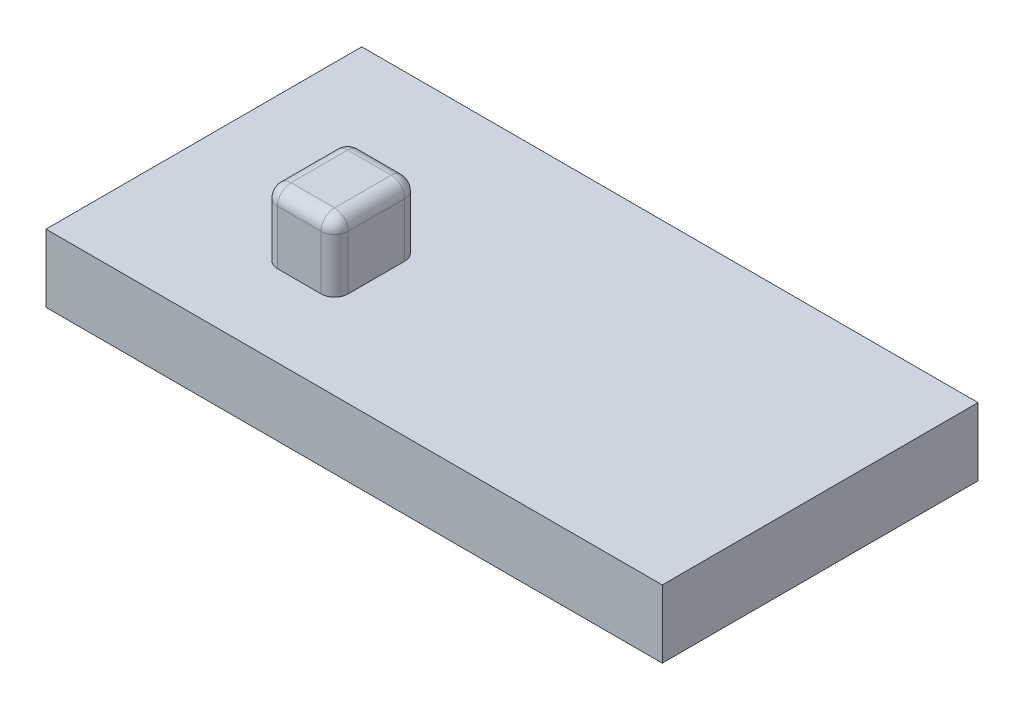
ISO-10303-21;
HEADER;
FILE_DESCRIPTION(('STEP AP214'),'2;1');
FILE_NAME('part.step','',(''),(''),'','','');
FILE_SCHEMA(('AUTOMOTIVE_DESIGN { 1 0 10303 214 1 1 1 1 }'));
ENDSEC;
DATA;
#1=APPLICATION_CONTEXT('core data for automotive mechanical design processes');
#2=APPLICATION_PROTOCOL_DEFINITION('international standard','automotive_design',2000,#1);
#3=PRODUCT_CONTEXT('',#1,'mechanical');
#4=PRODUCT('Part','Part','',(#3));
#5=PRODUCT_RELATED_PRODUCT_CATEGORY('part','',(#4));
#6=PRODUCT_DEFINITION_FORMATION('','',#4);
#7=PRODUCT_DEFINITION_CONTEXT('part definition',#1,'design');
#8=PRODUCT_DEFINITION('design','',#6,#7);
#9=PRODUCT_DEFINITION_SHAPE('','',#8);
#10=(LENGTH_UNIT() NAMED_UNIT(*) SI_UNIT(.MILLI.,.METRE.));
#11=(NAMED_UNIT(*) PLANE_ANGLE_UNIT() SI_UNIT($,.RADIAN.));
#12=(NAMED_UNIT(*) SI_UNIT($,.STERADIAN.) SOLID_ANGLE_UNIT());
#13=UNCERTAINTY_MEASURE_WITH_UNIT(LENGTH_MEASURE(1.E-05),#10,'distance_accuracy_value','');
#14=(GEOMETRIC_REPRESENTATION_CONTEXT(3) GLOBAL_UNCERTAINTY_ASSIGNED_CONTEXT((#13)) GLOBAL_UNIT_ASSIGNED_CONTEXT((#10,
#11,#12)) REPRESENTATION_CONTEXT('',''));
#15=CARTESIAN_POINT('',(0.,0.,0.));
#16=DIRECTION('',(0.,0.,1.));
#17=DIRECTION('',(1.,0.,0.));
#18=AXIS2_PLACEMENT_3D('',#15,#16,#17);
#19=CARTESIAN_POINT('',(-64.2406784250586,10.,15.1001488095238));
#20=DIRECTION('',(0.,1.,0.));
#21=DIRECTION('',(0.,0.,1.));
#22=AXIS2_PLACEMENT_3D('',#19,#20,#21);
#23=PLANE('',#22);
#24=DIRECTION('',(0.,0.,1.));
#25=VECTOR('',#24,1.);
#26=CARTESIAN_POINT('',(-64.2406784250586,10.,-31.4854166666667));
#27=LINE('',#26,#25);
#28=CARTESIAN_POINT('',(-64.2406784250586,10.,-31.4854166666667));
#29=VERTEX_POINT('',#28);
#30=CARTESIAN_POINT('',(-64.2406784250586,10.,15.1001488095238));
#31=VERTEX_POINT('',#30);
#32=EDGE_CURVE('E143',#29,#31,#27,.T.);
#33=ORIENTED_EDGE('',*,*,#32,.T.);
#34=DIRECTION('',(1.,0.,0.));
#35=VECTOR('',#34,1.);
#36=CARTESIAN_POINT('',(-64.2406784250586,10.,15.1001488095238));
#37=LINE('',#36,#35);
#38=CARTESIAN_POINT('',(26.681494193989,10.,15.1001488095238));
#39=VERTEX_POINT('',#38);
#40=EDGE_CURVE('E132',#31,#39,#37,.T.);
#41=ORIENTED_EDGE('',*,*,#40,.T.);
#42=DIRECTION('',(0.,0.,-1.));
#43=VECTOR('',#42,1.);
#44=CARTESIAN_POINT('',(26.681494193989,10.,-31.4854166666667));
#45=LINE('',#44,#43);
#46=CARTESIAN_POINT('',(26.681494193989,10.,-31.4854166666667));
#47=VERTEX_POINT('',#46);
#48=EDGE_CURVE('E142',#39,#47,#45,.T.);
#49=ORIENTED_EDGE('',*,*,#48,.T.);
#50=DIRECTION('',(-1.,0.,0.));
#51=VECTOR('',#50,1.);
#52=CARTESIAN_POINT('',(-64.2406784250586,10.,-31.4854166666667));
#53=LINE('',#52,#51);
#54=EDGE_CURVE('E148',#47,#29,#53,.T.);
#55=ORIENTED_EDGE('',*,*,#54,.T.);
#56=EDGE_LOOP('',(#33,#41,#49,#55));
#57=FACE_BOUND('',#56,.T.);
#58=DIRECTION('',(1.,0.,0.));
#59=VECTOR('',#58,1.);
#60=CARTESIAN_POINT('',(-44.0996781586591,10.,3.08627535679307));
#61=LINE('',#60,#59);
#62=CARTESIAN_POINT('',(-42.0996781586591,10.,3.08627535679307));
#63=VERTEX_POINT('',#62);
#64=CARTESIAN_POINT('',(-35.6738867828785,10.,3.08627535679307));
#65=VERTEX_POINT('',#64);
#66=EDGE_CURVE('E235',#63,#65,#61,.T.);
#67=ORIENTED_EDGE('',*,*,#66,.F.);
#68=CARTESIAN_POINT('',(-42.0996781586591,10.,1.08627535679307));
#69=DIRECTION('',(0.,1.,0.));
#70=DIRECTION('',(0.,0.,1.));
#71=AXIS2_PLACEMENT_3D('',#68,#69,#70);
#72=CIRCLE('',#71,2.);
#73=CARTESIAN_POINT('',(-44.0996781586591,10.,1.08627535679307));
#74=VERTEX_POINT('',#73);
#75=EDGE_CURVE('E11',#63,#74,#72,.F.);
#76=ORIENTED_EDGE('',*,*,#75,.T.);
#77=DIRECTION('',(0.,0.,1.));
#78=VECTOR('',#77,1.);
#79=CARTESIAN_POINT('',(-44.0996781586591,10.,-9.25409359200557));
#80=LINE('',#79,#78);
#81=CARTESIAN_POINT('',(-44.0996781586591,10.,-7.25409359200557));
#82=VERTEX_POINT('',#81);
#83=EDGE_CURVE('E232',#82,#74,#80,.T.);
#84=ORIENTED_EDGE('',*,*,#83,.F.);
#85=CARTESIAN_POINT('',(-42.0996781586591,10.,-7.25409359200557));
#86=DIRECTION('',(0.,1.,0.));
#87=DIRECTION('',(0.,0.,1.));
#88=AXIS2_PLACEMENT_3D('',#85,#86,#87);
#89=CIRCLE('',#88,2.);
#90=CARTESIAN_POINT('',(-42.0996781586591,10.,-9.25409359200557));
#91=VERTEX_POINT('',#90);
#92=EDGE_CURVE('E194',#82,#91,#89,.F.);
#93=ORIENTED_EDGE('',*,*,#92,.T.);
#94=DIRECTION('',(-1.,0.,0.));
#95=VECTOR('',#94,1.);
#96=CARTESIAN_POINT('',(-44.0996781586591,10.,-9.25409359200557));
#97=LINE('',#96,#95);
#98=CARTESIAN_POINT('',(-35.6738867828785,10.,-9.25409359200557));
#99=VERTEX_POINT('',#98);
#100=EDGE_CURVE('E245',#99,#91,#97,.T.);
#101=ORIENTED_EDGE('',*,*,#100,.F.);
#102=CARTESIAN_POINT('',(-35.6738867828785,10.,-7.25409359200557));
#103=DIRECTION('',(0.,1.,0.));
#104=DIRECTION('',(0.,0.,1.));
#105=AXIS2_PLACEMENT_3D('',#102,#103,#104);
#106=CIRCLE('',#105,2.);
#107=CARTESIAN_POINT('',(-33.6738867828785,10.,-7.25409359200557));
#108=VERTEX_POINT('',#107);
#109=EDGE_CURVE('E196',#99,#108,#106,.F.);
#110=ORIENTED_EDGE('',*,*,#109,.T.);
#111=DIRECTION('',(0.,0.,-1.));
#112=VECTOR('',#111,1.);
#113=CARTESIAN_POINT('',(-33.6738867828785,10.,-9.25409359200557));
#114=LINE('',#113,#112);
#115=CARTESIAN_POINT('',(-33.6738867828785,10.,1.08627535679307));
#116=VERTEX_POINT('',#115);
#117=EDGE_CURVE('E240',#116,#108,#114,.T.);
#118=ORIENTED_EDGE('',*,*,#117,.F.);
#119=CARTESIAN_POINT('',(-35.6738867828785,10.,1.08627535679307));
#120=DIRECTION('',(0.,1.,0.));
#121=DIRECTION('',(0.,0.,1.));
#122=AXIS2_PLACEMENT_3D('',#119,#120,#121);
#123=CIRCLE('',#122,2.);
#124=EDGE_CURVE('E39',#116,#65,#123,.F.);
#125=ORIENTED_EDGE('',*,*,#124,.T.);
#126=EDGE_LOOP('',(#67,#76,#84,#93,#101,#110,#118,#125));
#127=FACE_BOUND('',#126,.T.);
#128=ADVANCED_FACE('F30',(#57,#127),#23,.T.);
#129=CARTESIAN_POINT('',(-64.2406784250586,10.,-31.4854166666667));
#130=DIRECTION('',(1.,0.,0.));
#131=DIRECTION('',(0.,0.,-1.));
#132=AXIS2_PLACEMENT_3D('',#129,#130,#131);
#133=PLANE('',#132);
#134=DIRECTION('',(0.,0.,1.));
#135=VECTOR('',#134,1.);
#136=CARTESIAN_POINT('',(-64.2406784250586,0.,-31.4854166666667));
#137=LINE('',#136,#135);
#138=CARTESIAN_POINT('',(-64.2406784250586,0.,-31.4854166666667));
#139=VERTEX_POINT('',#138);
#140=CARTESIAN_POINT('',(-64.2406784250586,0.,15.1001488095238));
#141=VERTEX_POINT('',#140);
#142=EDGE_CURVE('E156',#139,#141,#137,.T.);
#143=ORIENTED_EDGE('',*,*,#142,.T.);
#144=DIRECTION('',(0.,-1.,0.));
#145=VECTOR('',#144,1.);
#146=CARTESIAN_POINT('',(-64.2406784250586,10.,15.1001488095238));
#147=LINE('',#146,#145);
#148=EDGE_CURVE('E136',#31,#141,#147,.T.);
#149=ORIENTED_EDGE('',*,*,#148,.F.);
#150=ORIENTED_EDGE('',*,*,#32,.F.);
#151=DIRECTION('',(0.,-1.,0.));
#152=VECTOR('',#151,1.);
#153=CARTESIAN_POINT('',(-64.2406784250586,10.,-31.4854166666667));
#154=LINE('',#153,#152);
#155=EDGE_CURVE('E250',#29,#139,#154,.T.);
#156=ORIENTED_EDGE('',*,*,#155,.T.);
#157=EDGE_LOOP('',(#143,#149,#150,#156));
#158=FACE_BOUND('',#157,.T.);
#159=ADVANCED_FACE('F154',(#158),#133,.F.);
#160=CARTESIAN_POINT('',(-64.2406784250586,10.,15.1001488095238));
#161=DIRECTION('',(0.,0.,-1.));
#162=DIRECTION('',(-1.,0.,0.));
#163=AXIS2_PLACEMENT_3D('',#160,#161,#162);
#164=PLANE('',#163);
#165=DIRECTION('',(1.,0.,0.));
#166=VECTOR('',#165,1.);
#167=CARTESIAN_POINT('',(-64.2406784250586,0.,15.1001488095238));
#168=LINE('',#167,#166);
#169=CARTESIAN_POINT('',(26.681494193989,0.,15.1001488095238));
#170=VERTEX_POINT('',#169);
#171=EDGE_CURVE('E252',#141,#170,#168,.T.);
#172=ORIENTED_EDGE('',*,*,#171,.T.);
#173=DIRECTION('',(0.,-1.,0.));
#174=VECTOR('',#173,1.);
#175=CARTESIAN_POINT('',(26.681494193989,10.,15.1001488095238));
#176=LINE('',#175,#174);
#177=EDGE_CURVE('E139',#39,#170,#176,.T.);
#178=ORIENTED_EDGE('',*,*,#177,.F.);
#179=ORIENTED_EDGE('',*,*,#40,.F.);
#180=ORIENTED_EDGE('',*,*,#148,.T.);
#181=EDGE_LOOP('',(#172,#178,#179,#180));
#182=FACE_BOUND('',#181,.T.);
#183=ADVANCED_FACE('F134',(#182),#164,.F.);
#184=CARTESIAN_POINT('',(26.681494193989,10.,-31.4854166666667));
#185=DIRECTION('',(-1.,0.,0.));
#186=DIRECTION('',(0.,0.,1.));
#187=AXIS2_PLACEMENT_3D('',#184,#185,#186);
#188=PLANE('',#187);
#189=DIRECTION('',(0.,0.,-1.));
#190=VECTOR('',#189,1.);
#191=CARTESIAN_POINT('',(26.681494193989,0.,-31.4854166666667));
#192=LINE('',#191,#190);
#193=CARTESIAN_POINT('',(26.681494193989,0.,-31.4854166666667));
#194=VERTEX_POINT('',#193);
#195=EDGE_CURVE('E254',#170,#194,#192,.T.);
#196=ORIENTED_EDGE('',*,*,#195,.T.);
#197=DIRECTION('',(0.,-1.,0.));
#198=VECTOR('',#197,1.);
#199=CARTESIAN_POINT('',(26.681494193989,10.,-31.4854166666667));
#200=LINE('',#199,#198);
#201=EDGE_CURVE('E161',#47,#194,#200,.T.);
#202=ORIENTED_EDGE('',*,*,#201,.F.);
#203=ORIENTED_EDGE('',*,*,#48,.F.);
#204=ORIENTED_EDGE('',*,*,#177,.T.);
#205=EDGE_LOOP('',(#196,#202,#203,#204));
#206=FACE_BOUND('',#205,.T.);
#207=ADVANCED_FACE('F266',(#206),#188,.F.);
#208=CARTESIAN_POINT('',(-64.2406784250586,10.,-31.4854166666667));
#209=DIRECTION('',(0.,0.,1.));
#210=DIRECTION('',(1.,0.,0.));
#211=AXIS2_PLACEMENT_3D('',#208,#209,#210);
#212=PLANE('',#211);
#213=DIRECTION('',(-1.,0.,0.));
#214=VECTOR('',#213,1.);
#215=CARTESIAN_POINT('',(-64.2406784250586,0.,-31.4854166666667));
#216=LINE('',#215,#214);
#217=EDGE_CURVE('E152',#194,#139,#216,.T.);
#218=ORIENTED_EDGE('',*,*,#217,.T.);
#219=ORIENTED_EDGE('',*,*,#155,.F.);
#220=ORIENTED_EDGE('',*,*,#54,.F.);
#221=ORIENTED_EDGE('',*,*,#201,.T.);
#222=EDGE_LOOP('',(#218,#219,#220,#221));
#223=FACE_BOUND('',#222,.T.);
#224=ADVANCED_FACE('F261',(#223),#212,.F.);
#225=CARTESIAN_POINT('',(-64.2406784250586,0.,15.1001488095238));
#226=DIRECTION('',(0.,1.,0.));
#227=DIRECTION('',(0.,0.,1.));
#228=AXIS2_PLACEMENT_3D('',#225,#226,#227);
#229=PLANE('',#228);
#230=ORIENTED_EDGE('',*,*,#142,.F.);
#231=ORIENTED_EDGE('',*,*,#217,.F.);
#232=ORIENTED_EDGE('',*,*,#195,.F.);
#233=ORIENTED_EDGE('',*,*,#171,.F.);
#234=EDGE_LOOP('',(#230,#231,#232,#233));
#235=FACE_BOUND('',#234,.T.);
#236=ADVANCED_FACE('F265',(#235),#229,.F.);
#237=CARTESIAN_POINT('',(-44.0996781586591,20.,-9.25409359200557));
#238=DIRECTION('',(1.,0.,0.));
#239=DIRECTION('',(0.,0.,-1.));
#240=AXIS2_PLACEMENT_3D('',#237,#238,#239);
#241=PLANE('',#240);
#242=DIRECTION('',(0.,0.,1.));
#243=VECTOR('',#242,1.);
#244=CARTESIAN_POINT('',(-44.0996781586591,18.,-9.25409359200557));
#245=LINE('',#244,#243);
#246=CARTESIAN_POINT('',(-44.0996781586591,18.,1.08627535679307));
#247=VERTEX_POINT('',#246);
#248=CARTESIAN_POINT('',(-44.0996781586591,18.,-7.25409359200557));
#249=VERTEX_POINT('',#248);
#250=EDGE_CURVE('E173',#247,#249,#245,.F.);
#251=ORIENTED_EDGE('',*,*,#250,.T.);
#252=DIRECTION('',(0.,-1.,0.));
#253=VECTOR('',#252,1.);
#254=CARTESIAN_POINT('',(-44.0996781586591,20.,-7.25409359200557));
#255=LINE('',#254,#253);
#256=EDGE_CURVE('E176',#249,#82,#255,.T.);
#257=ORIENTED_EDGE('',*,*,#256,.T.);
#258=ORIENTED_EDGE('',*,*,#83,.T.);
#259=DIRECTION('',(0.,-1.,0.));
#260=VECTOR('',#259,1.);
#261=CARTESIAN_POINT('',(-44.0996781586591,20.,1.08627535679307));
#262=LINE('',#261,#260);
#263=EDGE_CURVE('E171',#74,#247,#262,.F.);
#264=ORIENTED_EDGE('',*,*,#263,.T.);
#265=EDGE_LOOP('',(#251,#257,#258,#264));
#266=FACE_BOUND('',#265,.T.);
#267=ADVANCED_FACE('F283',(#266),#241,.F.);
#268=CARTESIAN_POINT('',(-44.0996781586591,20.,3.08627535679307));
#269=DIRECTION('',(0.,0.,-1.));
#270=DIRECTION('',(-1.,0.,0.));
#271=AXIS2_PLACEMENT_3D('',#268,#269,#270);
#272=PLANE('',#271);
#273=ORIENTED_EDGE('',*,*,#66,.T.);
#274=DIRECTION('',(0.,-1.,0.));
#275=VECTOR('',#274,1.);
#276=CARTESIAN_POINT('',(-35.6738867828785,20.,3.08627535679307));
#277=LINE('',#276,#275);
#278=CARTESIAN_POINT('',(-35.6738867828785,18.,3.08627535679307));
#279=VERTEX_POINT('',#278);
#280=EDGE_CURVE('E52',#65,#279,#277,.F.);
#281=ORIENTED_EDGE('',*,*,#280,.T.);
#282=DIRECTION('',(1.,0.,0.));
#283=VECTOR('',#282,1.);
#284=CARTESIAN_POINT('',(-44.0996781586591,18.,3.08627535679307));
#285=LINE('',#284,#283);
#286=CARTESIAN_POINT('',(-42.0996781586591,18.,3.08627535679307));
#287=VERTEX_POINT('',#286);
#288=EDGE_CURVE('E47',#279,#287,#285,.F.);
#289=ORIENTED_EDGE('',*,*,#288,.T.);
#290=DIRECTION('',(0.,-1.,0.));
#291=VECTOR('',#290,1.);
#292=CARTESIAN_POINT('',(-42.0996781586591,20.,3.08627535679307));
#293=LINE('',#292,#291);
#294=EDGE_CURVE('E191',#287,#63,#293,.T.);
#295=ORIENTED_EDGE('',*,*,#294,.T.);
#296=EDGE_LOOP('',(#273,#281,#289,#295));
#297=FACE_BOUND('',#296,.T.);
#298=ADVANCED_FACE('F289',(#297),#272,.F.);
#299=CARTESIAN_POINT('',(-33.6738867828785,20.,-9.25409359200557));
#300=DIRECTION('',(-1.,0.,0.));
#301=DIRECTION('',(0.,0.,1.));
#302=AXIS2_PLACEMENT_3D('',#299,#300,#301);
#303=PLANE('',#302);
#304=ORIENTED_EDGE('',*,*,#117,.T.);
#305=DIRECTION('',(0.,-1.,0.));
#306=VECTOR('',#305,1.);
#307=CARTESIAN_POINT('',(-33.6738867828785,20.,-7.25409359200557));
#308=LINE('',#307,#306);
#309=CARTESIAN_POINT('',(-33.6738867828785,18.,-7.25409359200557));
#310=VERTEX_POINT('',#309);
#311=EDGE_CURVE('E182',#108,#310,#308,.F.);
#312=ORIENTED_EDGE('',*,*,#311,.T.);
#313=DIRECTION('',(0.,0.,-1.));
#314=VECTOR('',#313,1.);
#315=CARTESIAN_POINT('',(-33.6738867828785,18.,3.08627535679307));
#316=LINE('',#315,#314);
#317=CARTESIAN_POINT('',(-33.6738867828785,18.,1.08627535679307));
#318=VERTEX_POINT('',#317);
#319=EDGE_CURVE('E180',#310,#318,#316,.F.);
#320=ORIENTED_EDGE('',*,*,#319,.T.);
#321=DIRECTION('',(0.,-1.,0.));
#322=VECTOR('',#321,1.);
#323=CARTESIAN_POINT('',(-33.6738867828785,20.,1.08627535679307));
#324=LINE('',#323,#322);
#325=EDGE_CURVE('E178',#318,#116,#324,.T.);
#326=ORIENTED_EDGE('',*,*,#325,.T.);
#327=EDGE_LOOP('',(#304,#312,#320,#326));
#328=FACE_BOUND('',#327,.T.);
#329=ADVANCED_FACE('F293',(#328),#303,.F.);
#330=CARTESIAN_POINT('',(-44.0996781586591,20.,-9.25409359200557));
#331=DIRECTION('',(0.,0.,1.));
#332=DIRECTION('',(1.,0.,0.));
#333=AXIS2_PLACEMENT_3D('',#330,#331,#332);
#334=PLANE('',#333);
#335=ORIENTED_EDGE('',*,*,#100,.T.);
#336=DIRECTION('',(0.,-1.,0.));
#337=VECTOR('',#336,1.);
#338=CARTESIAN_POINT('',(-42.0996781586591,20.,-9.25409359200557));
#339=LINE('',#338,#337);
#340=CARTESIAN_POINT('',(-42.0996781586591,18.,-9.25409359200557));
#341=VERTEX_POINT('',#340);
#342=EDGE_CURVE('E188',#91,#341,#339,.F.);
#343=ORIENTED_EDGE('',*,*,#342,.T.);
#344=DIRECTION('',(-1.,0.,0.));
#345=VECTOR('',#344,1.);
#346=CARTESIAN_POINT('',(-33.6738867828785,18.,-9.25409359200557));
#347=LINE('',#346,#345);
#348=CARTESIAN_POINT('',(-35.6738867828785,18.,-9.25409359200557));
#349=VERTEX_POINT('',#348);
#350=EDGE_CURVE('E186',#341,#349,#347,.F.);
#351=ORIENTED_EDGE('',*,*,#350,.T.);
#352=DIRECTION('',(0.,-1.,0.));
#353=VECTOR('',#352,1.);
#354=CARTESIAN_POINT('',(-35.6738867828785,20.,-9.25409359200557));
#355=LINE('',#354,#353);
#356=EDGE_CURVE('E184',#349,#99,#355,.T.);
#357=ORIENTED_EDGE('',*,*,#356,.T.);
#358=EDGE_LOOP('',(#335,#343,#351,#357));
#359=FACE_BOUND('',#358,.T.);
#360=ADVANCED_FACE('F328',(#359),#334,.F.);
#361=CARTESIAN_POINT('',(-44.0996781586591,20.,3.08627535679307));
#362=DIRECTION('',(0.,1.,0.));
#363=DIRECTION('',(0.,0.,1.));
#364=AXIS2_PLACEMENT_3D('',#361,#362,#363);
#365=PLANE('',#364);
#366=DIRECTION('',(0.,0.,-1.));
#367=VECTOR('',#366,1.);
#368=CARTESIAN_POINT('',(-35.6738867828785,20.,-9.25409359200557));
#369=LINE('',#368,#367);
#370=CARTESIAN_POINT('',(-35.6738867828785,20.,1.08627535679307));
#371=VERTEX_POINT('',#370);
#372=CARTESIAN_POINT('',(-35.6738867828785,20.,-7.25409359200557));
#373=VERTEX_POINT('',#372);
#374=EDGE_CURVE('E159',#371,#373,#369,.T.);
#375=ORIENTED_EDGE('',*,*,#374,.T.);
#376=DIRECTION('',(-1.,0.,0.));
#377=VECTOR('',#376,1.);
#378=CARTESIAN_POINT('',(-44.0996781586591,20.,-7.25409359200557));
#379=LINE('',#378,#377);
#380=CARTESIAN_POINT('',(-42.0996781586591,20.,-7.25409359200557));
#381=VERTEX_POINT('',#380);
#382=EDGE_CURVE('E169',#373,#381,#379,.T.);
#383=ORIENTED_EDGE('',*,*,#382,.T.);
#384=DIRECTION('',(0.,0.,1.));
#385=VECTOR('',#384,1.);
#386=CARTESIAN_POINT('',(-42.0996781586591,20.,3.08627535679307));
#387=LINE('',#386,#385);
#388=CARTESIAN_POINT('',(-42.0996781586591,20.,1.08627535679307));
#389=VERTEX_POINT('',#388);
#390=EDGE_CURVE('E166',#381,#389,#387,.T.);
#391=ORIENTED_EDGE('',*,*,#390,.T.);
#392=DIRECTION('',(1.,0.,0.));
#393=VECTOR('',#392,1.);
#394=CARTESIAN_POINT('',(-33.6738867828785,20.,1.08627535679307));
#395=LINE('',#394,#393);
#396=EDGE_CURVE('E157',#389,#371,#395,.T.);
#397=ORIENTED_EDGE('',*,*,#396,.T.);
#398=EDGE_LOOP('',(#375,#383,#391,#397));
#399=FACE_BOUND('',#398,.T.);
#400=ADVANCED_FACE('F311',(#399),#365,.T.);
#401=CARTESIAN_POINT('',(-35.6738867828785,20.,-7.25409359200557));
#402=DIRECTION('',(0.,-1.,0.));
#403=DIRECTION('',(0.,0.,-1.));
#404=AXIS2_PLACEMENT_3D('',#401,#402,#403);
#405=CYLINDRICAL_SURFACE('',#404,2.);
#406=ORIENTED_EDGE('',*,*,#109,.F.);
#407=ORIENTED_EDGE('',*,*,#356,.F.);
#408=CARTESIAN_POINT('',(-35.6738867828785,18.,-7.25409359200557));
#409=DIRECTION('',(0.,1.,0.));
#410=DIRECTION('',(0.,0.,1.));
#411=AXIS2_PLACEMENT_3D('',#408,#409,#410);
#412=CIRCLE('',#411,2.);
#413=EDGE_CURVE('E34',#310,#349,#412,.T.);
#414=ORIENTED_EDGE('',*,*,#413,.F.);
#415=ORIENTED_EDGE('',*,*,#311,.F.);
#416=EDGE_LOOP('',(#406,#407,#414,#415));
#417=FACE_BOUND('',#416,.T.);
#418=ADVANCED_FACE('F32',(#417),#405,.T.);
#419=CARTESIAN_POINT('',(-35.6738867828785,18.,3.08627535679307));
#420=DIRECTION('',(0.,0.,1.));
#421=DIRECTION('',(1.,0.,0.));
#422=AXIS2_PLACEMENT_3D('',#419,#420,#421);
#423=CYLINDRICAL_SURFACE('',#422,2.);
#424=CARTESIAN_POINT('',(-35.6738867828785,18.,1.08627535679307));
#425=DIRECTION('',(0.,0.,1.));
#426=DIRECTION('',(1.,0.,0.));
#427=AXIS2_PLACEMENT_3D('',#424,#425,#426);
#428=CIRCLE('',#427,2.);
#429=EDGE_CURVE('E224',#318,#371,#428,.T.);
#430=ORIENTED_EDGE('',*,*,#429,.F.);
#431=ORIENTED_EDGE('',*,*,#319,.F.);
#432=CARTESIAN_POINT('',(-35.6738867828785,18.,-7.25409359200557));
#433=DIRECTION('',(0.,0.,-1.));
#434=DIRECTION('',(-1.,0.,0.));
#435=AXIS2_PLACEMENT_3D('',#432,#433,#434);
#436=CIRCLE('',#435,2.);
#437=EDGE_CURVE('E226',#373,#310,#436,.T.);
#438=ORIENTED_EDGE('',*,*,#437,.F.);
#439=ORIENTED_EDGE('',*,*,#374,.F.);
#440=EDGE_LOOP('',(#430,#431,#438,#439));
#441=FACE_BOUND('',#440,.T.);
#442=ADVANCED_FACE('F341',(#441),#423,.T.);
#443=CARTESIAN_POINT('',(-35.6738867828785,20.,1.08627535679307));
#444=DIRECTION('',(0.,-1.,0.));
#445=DIRECTION('',(0.,0.,-1.));
#446=AXIS2_PLACEMENT_3D('',#443,#444,#445);
#447=CYLINDRICAL_SURFACE('',#446,2.);
#448=ORIENTED_EDGE('',*,*,#124,.F.);
#449=ORIENTED_EDGE('',*,*,#325,.F.);
#450=CARTESIAN_POINT('',(-35.6738867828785,18.,1.08627535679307));
#451=DIRECTION('',(0.,1.,0.));
#452=DIRECTION('',(0.,0.,1.));
#453=AXIS2_PLACEMENT_3D('',#450,#451,#452);
#454=CIRCLE('',#453,2.);
#455=EDGE_CURVE('E221',#279,#318,#454,.T.);
#456=ORIENTED_EDGE('',*,*,#455,.F.);
#457=ORIENTED_EDGE('',*,*,#280,.F.);
#458=EDGE_LOOP('',(#448,#449,#456,#457));
#459=FACE_BOUND('',#458,.T.);
#460=ADVANCED_FACE('F339',(#459),#447,.T.);
#461=CARTESIAN_POINT('',(-35.6738867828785,18.,-7.25409359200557));
#462=DIRECTION('',(0.,0.,1.));
#463=DIRECTION('',(1.,0.,0.));
#464=AXIS2_PLACEMENT_3D('',#461,#462,#463);
#465=SPHERICAL_SURFACE('',#464,2.);
#466=ORIENTED_EDGE('',*,*,#437,.T.);
#467=ORIENTED_EDGE('',*,*,#413,.T.);
#468=CARTESIAN_POINT('',(-35.6738867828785,18.,-7.25409359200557));
#469=DIRECTION('',(1.,0.,0.));
#470=DIRECTION('',(0.,0.,-1.));
#471=AXIS2_PLACEMENT_3D('',#468,#469,#470);
#472=CIRCLE('',#471,2.);
#473=EDGE_CURVE('E218',#373,#349,#472,.F.);
#474=ORIENTED_EDGE('',*,*,#473,.F.);
#475=EDGE_LOOP('',(#466,#467,#474));
#476=FACE_BOUND('',#475,.T.);
#477=ADVANCED_FACE('F345',(#476),#465,.T.);
#478=CARTESIAN_POINT('',(-35.6738867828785,18.,1.08627535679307));
#479=DIRECTION('',(0.,0.,1.));
#480=DIRECTION('',(1.,0.,0.));
#481=AXIS2_PLACEMENT_3D('',#478,#479,#480);
#482=SPHERICAL_SURFACE('',#481,2.);
#483=ORIENTED_EDGE('',*,*,#455,.T.);
#484=ORIENTED_EDGE('',*,*,#429,.T.);
#485=CARTESIAN_POINT('',(-35.6738867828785,18.,1.08627535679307));
#486=DIRECTION('',(1.,0.,0.));
#487=DIRECTION('',(0.,0.,-1.));
#488=AXIS2_PLACEMENT_3D('',#485,#486,#487);
#489=CIRCLE('',#488,2.);
#490=EDGE_CURVE('E215',#279,#371,#489,.F.);
#491=ORIENTED_EDGE('',*,*,#490,.F.);
#492=EDGE_LOOP('',(#483,#484,#491));
#493=FACE_BOUND('',#492,.T.);
#494=ADVANCED_FACE('F343',(#493),#482,.T.);
#495=CARTESIAN_POINT('',(-42.0996781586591,20.,-7.25409359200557));
#496=DIRECTION('',(0.,-1.,0.));
#497=DIRECTION('',(0.,0.,-1.));
#498=AXIS2_PLACEMENT_3D('',#495,#496,#497);
#499=CYLINDRICAL_SURFACE('',#498,2.);
#500=ORIENTED_EDGE('',*,*,#92,.F.);
#501=ORIENTED_EDGE('',*,*,#256,.F.);
#502=CARTESIAN_POINT('',(-42.0996781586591,18.,-7.25409359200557));
#503=DIRECTION('',(0.,1.,0.));
#504=DIRECTION('',(0.,0.,1.));
#505=AXIS2_PLACEMENT_3D('',#502,#503,#504);
#506=CIRCLE('',#505,2.);
#507=EDGE_CURVE('E212',#341,#249,#506,.T.);
#508=ORIENTED_EDGE('',*,*,#507,.F.);
#509=ORIENTED_EDGE('',*,*,#342,.F.);
#510=EDGE_LOOP('',(#500,#501,#508,#509));
#511=FACE_BOUND('',#510,.T.);
#512=ADVANCED_FACE('F323',(#511),#499,.T.);
#513=CARTESIAN_POINT('',(-44.0996781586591,18.,-7.25409359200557));
#514=DIRECTION('',(1.,0.,0.));
#515=DIRECTION('',(0.,0.,-1.));
#516=AXIS2_PLACEMENT_3D('',#513,#514,#515);
#517=CYLINDRICAL_SURFACE('',#516,2.);
#518=ORIENTED_EDGE('',*,*,#473,.T.);
#519=ORIENTED_EDGE('',*,*,#350,.F.);
#520=CARTESIAN_POINT('',(-42.0996781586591,18.,-7.25409359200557));
#521=DIRECTION('',(-1.,0.,0.));
#522=DIRECTION('',(0.,0.,1.));
#523=AXIS2_PLACEMENT_3D('',#520,#521,#522);
#524=CIRCLE('',#523,2.);
#525=EDGE_CURVE('E209',#381,#341,#524,.T.);
#526=ORIENTED_EDGE('',*,*,#525,.F.);
#527=ORIENTED_EDGE('',*,*,#382,.F.);
#528=EDGE_LOOP('',(#518,#519,#526,#527));
#529=FACE_BOUND('',#528,.T.);
#530=ADVANCED_FACE('F316',(#529),#517,.T.);
#531=CARTESIAN_POINT('',(-44.0996781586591,18.,1.08627535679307));
#532=DIRECTION('',(-1.,0.,0.));
#533=DIRECTION('',(0.,0.,1.));
#534=AXIS2_PLACEMENT_3D('',#531,#532,#533);
#535=CYLINDRICAL_SURFACE('',#534,2.);
#536=ORIENTED_EDGE('',*,*,#490,.T.);
#537=ORIENTED_EDGE('',*,*,#396,.F.);
#538=CARTESIAN_POINT('',(-42.0996781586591,18.,1.08627535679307));
#539=DIRECTION('',(-1.,0.,0.));
#540=DIRECTION('',(0.,0.,1.));
#541=AXIS2_PLACEMENT_3D('',#538,#539,#540);
#542=CIRCLE('',#541,2.);
#543=EDGE_CURVE('E206',#287,#389,#542,.T.);
#544=ORIENTED_EDGE('',*,*,#543,.F.);
#545=ORIENTED_EDGE('',*,*,#288,.F.);
#546=EDGE_LOOP('',(#536,#537,#544,#545));
#547=FACE_BOUND('',#546,.T.);
#548=ADVANCED_FACE('F307',(#547),#535,.T.);
#549=CARTESIAN_POINT('',(-42.0996781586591,20.,1.08627535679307));
#550=DIRECTION('',(0.,-1.,0.));
#551=DIRECTION('',(0.,0.,-1.));
#552=AXIS2_PLACEMENT_3D('',#549,#550,#551);
#553=CYLINDRICAL_SURFACE('',#552,2.);
#554=ORIENTED_EDGE('',*,*,#75,.F.);
#555=ORIENTED_EDGE('',*,*,#294,.F.);
#556=CARTESIAN_POINT('',(-42.0996781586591,18.,1.08627535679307));
#557=DIRECTION('',(0.,1.,0.));
#558=DIRECTION('',(0.,0.,1.));
#559=AXIS2_PLACEMENT_3D('',#556,#557,#558);
#560=CIRCLE('',#559,2.);
#561=EDGE_CURVE('E203',#247,#287,#560,.T.);
#562=ORIENTED_EDGE('',*,*,#561,.F.);
#563=ORIENTED_EDGE('',*,*,#263,.F.);
#564=EDGE_LOOP('',(#554,#555,#562,#563));
#565=FACE_BOUND('',#564,.T.);
#566=ADVANCED_FACE('F428',(#565),#553,.T.);
#567=CARTESIAN_POINT('',(-42.0996781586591,18.,-7.25409359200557));
#568=DIRECTION('',(0.,0.,1.));
#569=DIRECTION('',(1.,0.,0.));
#570=AXIS2_PLACEMENT_3D('',#567,#568,#569);
#571=SPHERICAL_SURFACE('',#570,2.);
#572=ORIENTED_EDGE('',*,*,#525,.T.);
#573=ORIENTED_EDGE('',*,*,#507,.T.);
#574=CARTESIAN_POINT('',(-42.0996781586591,18.,-7.25409359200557));
#575=DIRECTION('',(0.,0.,-1.));
#576=DIRECTION('',(-1.,0.,0.));
#577=AXIS2_PLACEMENT_3D('',#574,#575,#576);
#578=CIRCLE('',#577,2.);
#579=EDGE_CURVE('E201',#381,#249,#578,.F.);
#580=ORIENTED_EDGE('',*,*,#579,.F.);
#581=EDGE_LOOP('',(#572,#573,#580));
#582=FACE_BOUND('',#581,.T.);
#583=ADVANCED_FACE('F319',(#582),#571,.T.);
#584=CARTESIAN_POINT('',(-42.0996781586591,18.,1.08627535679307));
#585=DIRECTION('',(0.,0.,1.));
#586=DIRECTION('',(1.,0.,0.));
#587=AXIS2_PLACEMENT_3D('',#584,#585,#586);
#588=SPHERICAL_SURFACE('',#587,2.);
#589=ORIENTED_EDGE('',*,*,#561,.T.);
#590=ORIENTED_EDGE('',*,*,#543,.T.);
#591=CARTESIAN_POINT('',(-42.0996781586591,18.,1.08627535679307));
#592=DIRECTION('',(0.,0.,1.));
#593=DIRECTION('',(1.,0.,0.));
#594=AXIS2_PLACEMENT_3D('',#591,#592,#593);
#595=CIRCLE('',#594,2.);
#596=EDGE_CURVE('E199',#247,#389,#595,.F.);
#597=ORIENTED_EDGE('',*,*,#596,.F.);
#598=EDGE_LOOP('',(#589,#590,#597));
#599=FACE_BOUND('',#598,.T.);
#600=ADVANCED_FACE('F303',(#599),#588,.T.);
#601=CARTESIAN_POINT('',(-42.0996781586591,18.,3.08627535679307));
#602=DIRECTION('',(0.,0.,-1.));
#603=DIRECTION('',(-1.,0.,0.));
#604=AXIS2_PLACEMENT_3D('',#601,#602,#603);
#605=CYLINDRICAL_SURFACE('',#604,2.);
#606=ORIENTED_EDGE('',*,*,#579,.T.);
#607=ORIENTED_EDGE('',*,*,#250,.F.);
#608=ORIENTED_EDGE('',*,*,#596,.T.);
#609=ORIENTED_EDGE('',*,*,#390,.F.);
#610=EDGE_LOOP('',(#606,#607,#608,#609));
#611=FACE_BOUND('',#610,.T.);
#612=ADVANCED_FACE('F299',(#611),#605,.T.);
#613=CLOSED_SHELL('',(#128,#159,#183,#207,#224,#236,#267,#298,#329,#360,#400,#418,#442,#460,
#477,#494,#512,#530,#548,#566,#583,#600,#612));
#614=MANIFOLD_SOLID_BREP('B2',#613);
#615=ADVANCED_BREP_SHAPE_REPRESENTATION('',(#18,#614),#14);
#616=SHAPE_DEFINITION_REPRESENTATION(#9,#615);
ENDSEC;
END-ISO-10303-21;
